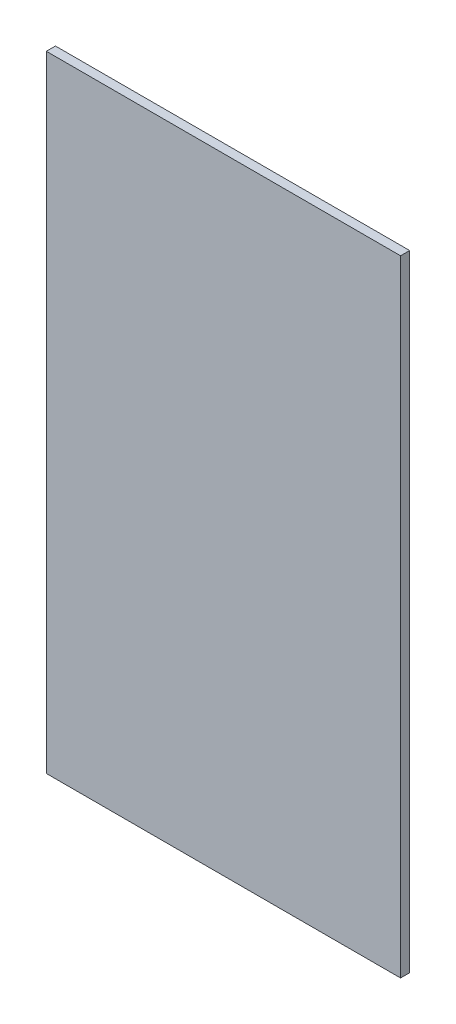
from build123d import *

# Parameters (mm, degrees)
SKETCH1_W           = 700
SKETCH1_H           = 1236
BOSS_EXTRUDE1_DEPTH = 18


with BuildPart() as part:
    # Sketch1 → Boss-Extrude1 (new body)
    with BuildSketch(Plane.XY):
        Rectangle(SKETCH1_W, SKETCH1_H)
    extrude(amount=BOSS_EXTRUDE1_DEPTH)


solid = part.part
